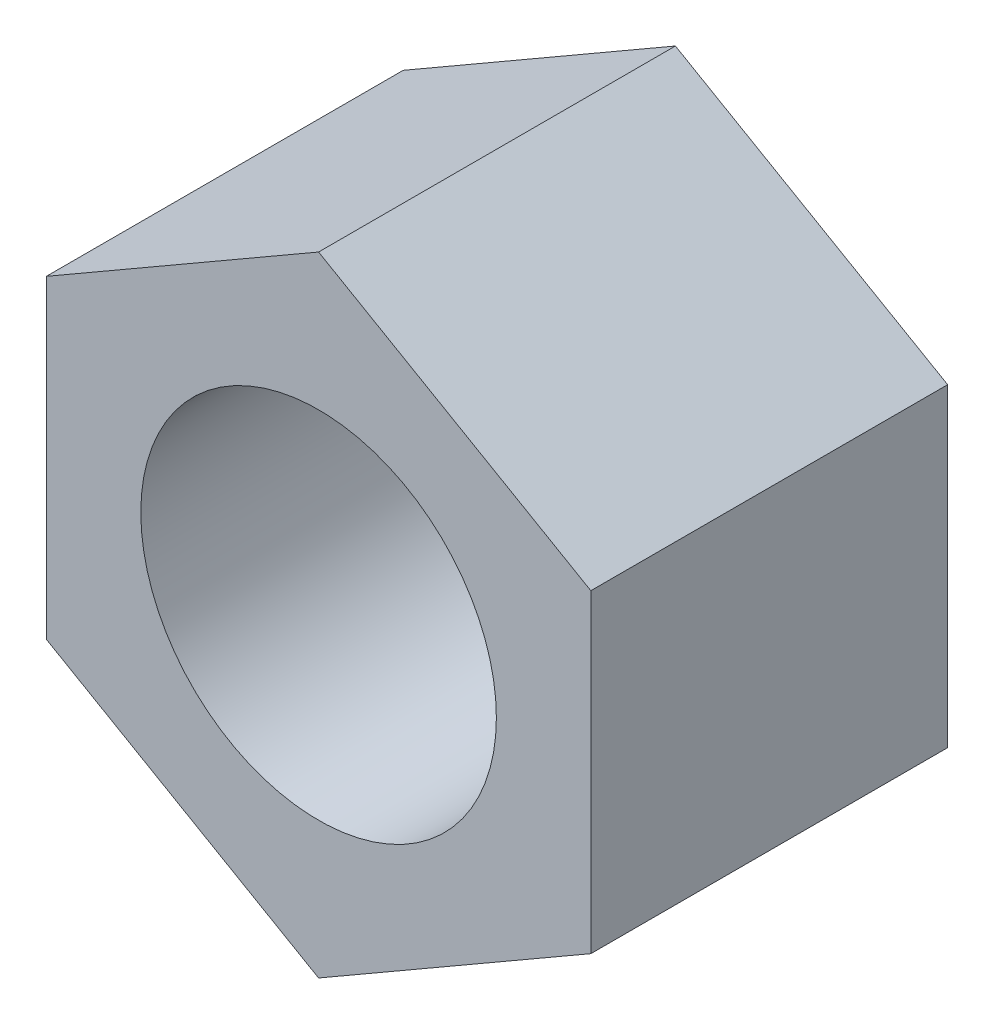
ISO-10303-21;
HEADER;
FILE_DESCRIPTION(('STEP AP214'),'2;1');
FILE_NAME('part.step','',(''),(''),'','','');
FILE_SCHEMA(('AUTOMOTIVE_DESIGN { 1 0 10303 214 1 1 1 1 }'));
ENDSEC;
DATA;
#1=APPLICATION_CONTEXT('core data for automotive mechanical design processes');
#2=APPLICATION_PROTOCOL_DEFINITION('international standard','automotive_design',2000,#1);
#3=PRODUCT_CONTEXT('',#1,'mechanical');
#4=PRODUCT('Part','Part','',(#3));
#5=PRODUCT_RELATED_PRODUCT_CATEGORY('part','',(#4));
#6=PRODUCT_DEFINITION_FORMATION('','',#4);
#7=PRODUCT_DEFINITION_CONTEXT('part definition',#1,'design');
#8=PRODUCT_DEFINITION('design','',#6,#7);
#9=PRODUCT_DEFINITION_SHAPE('','',#8);
#10=(LENGTH_UNIT() NAMED_UNIT(*) SI_UNIT(.MILLI.,.METRE.));
#11=(NAMED_UNIT(*) PLANE_ANGLE_UNIT() SI_UNIT($,.RADIAN.));
#12=(NAMED_UNIT(*) SI_UNIT($,.STERADIAN.) SOLID_ANGLE_UNIT());
#13=UNCERTAINTY_MEASURE_WITH_UNIT(LENGTH_MEASURE(1.E-05),#10,'distance_accuracy_value','');
#14=(GEOMETRIC_REPRESENTATION_CONTEXT(3) GLOBAL_UNCERTAINTY_ASSIGNED_CONTEXT((#13)) GLOBAL_UNIT_ASSIGNED_CONTEXT((#10,
#11,#12)) REPRESENTATION_CONTEXT('',''));
#15=CARTESIAN_POINT('',(0.,0.,0.));
#16=DIRECTION('',(0.,0.,1.));
#17=DIRECTION('',(1.,0.,0.));
#18=AXIS2_PLACEMENT_3D('',#15,#16,#17);
#19=CARTESIAN_POINT('',(0.,0.,101.9556));
#20=DIRECTION('',(0.,0.,1.));
#21=DIRECTION('',(1.,0.,0.));
#22=AXIS2_PLACEMENT_3D('',#19,#20,#21);
#23=PLANE('',#22);
#24=DIRECTION('',(-0.866025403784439,0.5,0.));
#25=VECTOR('',#24,1.);
#26=CARTESIAN_POINT('',(77.7875,44.910634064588,101.9556));
#27=LINE('',#26,#25);
#28=CARTESIAN_POINT('',(77.7875,44.910634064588,101.9556));
#29=VERTEX_POINT('',#28);
#30=CARTESIAN_POINT('',(0.,89.821268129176,101.9556));
#31=VERTEX_POINT('',#30);
#32=EDGE_CURVE('E137',#29,#31,#27,.T.);
#33=ORIENTED_EDGE('',*,*,#32,.T.);
#34=DIRECTION('',(-0.866025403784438,-0.5,0.));
#35=VECTOR('',#34,1.);
#36=CARTESIAN_POINT('',(0.,89.821268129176,101.9556));
#37=LINE('',#36,#35);
#38=CARTESIAN_POINT('',(-77.7875,44.910634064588,101.9556));
#39=VERTEX_POINT('',#38);
#40=EDGE_CURVE('E100',#31,#39,#37,.T.);
#41=ORIENTED_EDGE('',*,*,#40,.T.);
#42=DIRECTION('',(0.,-1.,0.));
#43=VECTOR('',#42,1.);
#44=CARTESIAN_POINT('',(-77.7875,44.910634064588,101.9556));
#45=LINE('',#44,#43);
#46=CARTESIAN_POINT('',(-77.7875,-44.910634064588,101.9556));
#47=VERTEX_POINT('',#46);
#48=EDGE_CURVE('E109',#39,#47,#45,.T.);
#49=ORIENTED_EDGE('',*,*,#48,.T.);
#50=DIRECTION('',(0.866025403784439,-0.5,0.));
#51=VECTOR('',#50,1.);
#52=CARTESIAN_POINT('',(-77.7875,-44.910634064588,101.9556));
#53=LINE('',#52,#51);
#54=CARTESIAN_POINT('',(0.,-89.821268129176,101.9556));
#55=VERTEX_POINT('',#54);
#56=EDGE_CURVE('E102',#47,#55,#53,.T.);
#57=ORIENTED_EDGE('',*,*,#56,.T.);
#58=DIRECTION('',(0.866025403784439,0.5,0.));
#59=VECTOR('',#58,1.);
#60=CARTESIAN_POINT('',(0.,-89.821268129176,101.9556));
#61=LINE('',#60,#59);
#62=CARTESIAN_POINT('',(77.7875,-44.910634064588,101.9556));
#63=VERTEX_POINT('',#62);
#64=EDGE_CURVE('E107',#55,#63,#61,.T.);
#65=ORIENTED_EDGE('',*,*,#64,.T.);
#66=DIRECTION('',(0.,1.,0.));
#67=VECTOR('',#66,1.);
#68=CARTESIAN_POINT('',(77.7875,-44.910634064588,101.9556));
#69=LINE('',#68,#67);
#70=EDGE_CURVE('E58',#63,#29,#69,.T.);
#71=ORIENTED_EDGE('',*,*,#70,.T.);
#72=EDGE_LOOP('',(#33,#41,#49,#57,#65,#71));
#73=FACE_BOUND('',#72,.T.);
#74=CARTESIAN_POINT('',(0.,0.,101.9556));
#75=DIRECTION('',(0.,0.,1.));
#76=DIRECTION('',(1.,0.,0.));
#77=AXIS2_PLACEMENT_3D('',#74,#75,#76);
#78=CIRCLE('',#77,50.8);
#79=CARTESIAN_POINT('',(50.8,0.,101.9556));
#80=VERTEX_POINT('',#79);
#81=EDGE_CURVE('E135',#80,#80,#78,.T.);
#82=ORIENTED_EDGE('',*,*,#81,.F.);
#83=EDGE_LOOP('',(#82));
#84=FACE_BOUND('',#83,.T.);
#85=ADVANCED_FACE('F43',(#73,#84),#23,.T.);
#86=CARTESIAN_POINT('',(0.,0.,0.));
#87=DIRECTION('',(0.,0.,1.));
#88=DIRECTION('',(1.,0.,0.));
#89=AXIS2_PLACEMENT_3D('',#86,#87,#88);
#90=PLANE('',#89);
#91=DIRECTION('',(-0.866025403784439,0.5,0.));
#92=VECTOR('',#91,1.);
#93=CARTESIAN_POINT('',(77.7875,44.910634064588,0.));
#94=LINE('',#93,#92);
#95=CARTESIAN_POINT('',(77.7875,44.910634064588,0.));
#96=VERTEX_POINT('',#95);
#97=CARTESIAN_POINT('',(0.,89.821268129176,0.));
#98=VERTEX_POINT('',#97);
#99=EDGE_CURVE('E126',#96,#98,#94,.T.);
#100=ORIENTED_EDGE('',*,*,#99,.F.);
#101=DIRECTION('',(0.,1.,0.));
#102=VECTOR('',#101,1.);
#103=CARTESIAN_POINT('',(77.7875,-44.910634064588,0.));
#104=LINE('',#103,#102);
#105=CARTESIAN_POINT('',(77.7875,-44.910634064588,0.));
#106=VERTEX_POINT('',#105);
#107=EDGE_CURVE('E90',#106,#96,#104,.T.);
#108=ORIENTED_EDGE('',*,*,#107,.F.);
#109=DIRECTION('',(0.866025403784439,0.5,0.));
#110=VECTOR('',#109,1.);
#111=CARTESIAN_POINT('',(0.,-89.821268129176,0.));
#112=LINE('',#111,#110);
#113=CARTESIAN_POINT('',(0.,-89.821268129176,0.));
#114=VERTEX_POINT('',#113);
#115=EDGE_CURVE('E83',#114,#106,#112,.T.);
#116=ORIENTED_EDGE('',*,*,#115,.F.);
#117=DIRECTION('',(0.866025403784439,-0.5,0.));
#118=VECTOR('',#117,1.);
#119=CARTESIAN_POINT('',(-77.7875,-44.910634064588,0.));
#120=LINE('',#119,#118);
#121=CARTESIAN_POINT('',(-77.7875,-44.910634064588,0.));
#122=VERTEX_POINT('',#121);
#123=EDGE_CURVE('E119',#122,#114,#120,.T.);
#124=ORIENTED_EDGE('',*,*,#123,.F.);
#125=DIRECTION('',(0.,-1.,0.));
#126=VECTOR('',#125,1.);
#127=CARTESIAN_POINT('',(-77.7875,44.910634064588,0.));
#128=LINE('',#127,#126);
#129=CARTESIAN_POINT('',(-77.7875,44.910634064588,0.));
#130=VERTEX_POINT('',#129);
#131=EDGE_CURVE('E131',#130,#122,#128,.T.);
#132=ORIENTED_EDGE('',*,*,#131,.F.);
#133=DIRECTION('',(-0.866025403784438,-0.5,0.));
#134=VECTOR('',#133,1.);
#135=CARTESIAN_POINT('',(0.,89.821268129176,0.));
#136=LINE('',#135,#134);
#137=EDGE_CURVE('E132',#98,#130,#136,.T.);
#138=ORIENTED_EDGE('',*,*,#137,.F.);
#139=EDGE_LOOP('',(#100,#108,#116,#124,#132,#138));
#140=FACE_BOUND('',#139,.T.);
#141=CARTESIAN_POINT('',(0.,0.,0.));
#142=DIRECTION('',(0.,0.,1.));
#143=DIRECTION('',(1.,0.,0.));
#144=AXIS2_PLACEMENT_3D('',#141,#142,#143);
#145=CIRCLE('',#144,50.8);
#146=CARTESIAN_POINT('',(50.8,0.,0.));
#147=VERTEX_POINT('',#146);
#148=EDGE_CURVE('E235',#147,#147,#145,.T.);
#149=ORIENTED_EDGE('',*,*,#148,.T.);
#150=EDGE_LOOP('',(#149));
#151=FACE_BOUND('',#150,.T.);
#152=ADVANCED_FACE('F146',(#140,#151),#90,.F.);
#153=CARTESIAN_POINT('',(77.7875,44.910634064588,101.9556));
#154=DIRECTION('',(-0.5,-0.866025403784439,0.));
#155=DIRECTION('',(0.866025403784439,-0.5,0.));
#156=AXIS2_PLACEMENT_3D('',#153,#154,#155);
#157=PLANE('',#156);
#158=ORIENTED_EDGE('',*,*,#99,.T.);
#159=DIRECTION('',(0.,0.,-1.));
#160=VECTOR('',#159,1.);
#161=CARTESIAN_POINT('',(0.,89.821268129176,101.9556));
#162=LINE('',#161,#160);
#163=EDGE_CURVE('E11',#31,#98,#162,.T.);
#164=ORIENTED_EDGE('',*,*,#163,.F.);
#165=ORIENTED_EDGE('',*,*,#32,.F.);
#166=DIRECTION('',(0.,0.,-1.));
#167=VECTOR('',#166,1.);
#168=CARTESIAN_POINT('',(77.7875,44.910634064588,101.9556));
#169=LINE('',#168,#167);
#170=EDGE_CURVE('E122',#29,#96,#169,.T.);
#171=ORIENTED_EDGE('',*,*,#170,.T.);
#172=EDGE_LOOP('',(#158,#164,#165,#171));
#173=FACE_BOUND('',#172,.T.);
#174=ADVANCED_FACE('F44',(#173),#157,.F.);
#175=CARTESIAN_POINT('',(0.,89.821268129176,101.9556));
#176=DIRECTION('',(0.5,-0.866025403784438,0.));
#177=DIRECTION('',(0.866025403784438,0.5,0.));
#178=AXIS2_PLACEMENT_3D('',#175,#176,#177);
#179=PLANE('',#178);
#180=ORIENTED_EDGE('',*,*,#137,.T.);
#181=DIRECTION('',(0.,0.,-1.));
#182=VECTOR('',#181,1.);
#183=CARTESIAN_POINT('',(-77.7875,44.910634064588,101.9556));
#184=LINE('',#183,#182);
#185=EDGE_CURVE('E55',#39,#130,#184,.T.);
#186=ORIENTED_EDGE('',*,*,#185,.F.);
#187=ORIENTED_EDGE('',*,*,#40,.F.);
#188=ORIENTED_EDGE('',*,*,#163,.T.);
#189=EDGE_LOOP('',(#180,#186,#187,#188));
#190=FACE_BOUND('',#189,.T.);
#191=ADVANCED_FACE('F174',(#190),#179,.F.);
#192=CARTESIAN_POINT('',(-77.7875,44.910634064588,101.9556));
#193=DIRECTION('',(1.,0.,0.));
#194=DIRECTION('',(0.,1.,0.));
#195=AXIS2_PLACEMENT_3D('',#192,#193,#194);
#196=PLANE('',#195);
#197=ORIENTED_EDGE('',*,*,#131,.T.);
#198=DIRECTION('',(0.,0.,-1.));
#199=VECTOR('',#198,1.);
#200=CARTESIAN_POINT('',(-77.7875,-44.910634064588,101.9556));
#201=LINE('',#200,#199);
#202=EDGE_CURVE('E116',#47,#122,#201,.T.);
#203=ORIENTED_EDGE('',*,*,#202,.F.);
#204=ORIENTED_EDGE('',*,*,#48,.F.);
#205=ORIENTED_EDGE('',*,*,#185,.T.);
#206=EDGE_LOOP('',(#197,#203,#204,#205));
#207=FACE_BOUND('',#206,.T.);
#208=ADVANCED_FACE('F144',(#207),#196,.F.);
#209=CARTESIAN_POINT('',(-77.7875,-44.910634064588,101.9556));
#210=DIRECTION('',(0.5,0.866025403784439,0.));
#211=DIRECTION('',(-0.866025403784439,0.5,0.));
#212=AXIS2_PLACEMENT_3D('',#209,#210,#211);
#213=PLANE('',#212);
#214=ORIENTED_EDGE('',*,*,#123,.T.);
#215=DIRECTION('',(0.,0.,-1.));
#216=VECTOR('',#215,1.);
#217=CARTESIAN_POINT('',(0.,-89.821268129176,101.9556));
#218=LINE('',#217,#216);
#219=EDGE_CURVE('E113',#55,#114,#218,.T.);
#220=ORIENTED_EDGE('',*,*,#219,.F.);
#221=ORIENTED_EDGE('',*,*,#56,.F.);
#222=ORIENTED_EDGE('',*,*,#202,.T.);
#223=EDGE_LOOP('',(#214,#220,#221,#222));
#224=FACE_BOUND('',#223,.T.);
#225=ADVANCED_FACE('F117',(#224),#213,.F.);
#226=CARTESIAN_POINT('',(0.,-89.821268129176,101.9556));
#227=DIRECTION('',(-0.5,0.866025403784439,0.));
#228=DIRECTION('',(-0.866025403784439,-0.5,0.));
#229=AXIS2_PLACEMENT_3D('',#226,#227,#228);
#230=PLANE('',#229);
#231=ORIENTED_EDGE('',*,*,#115,.T.);
#232=DIRECTION('',(0.,0.,-1.));
#233=VECTOR('',#232,1.);
#234=CARTESIAN_POINT('',(77.7875,-44.910634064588,101.9556));
#235=LINE('',#234,#233);
#236=EDGE_CURVE('E118',#63,#106,#235,.T.);
#237=ORIENTED_EDGE('',*,*,#236,.F.);
#238=ORIENTED_EDGE('',*,*,#64,.F.);
#239=ORIENTED_EDGE('',*,*,#219,.T.);
#240=EDGE_LOOP('',(#231,#237,#238,#239));
#241=FACE_BOUND('',#240,.T.);
#242=ADVANCED_FACE('F125',(#241),#230,.F.);
#243=CARTESIAN_POINT('',(77.7875,-44.910634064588,101.9556));
#244=DIRECTION('',(-1.,0.,0.));
#245=DIRECTION('',(0.,0.,1.));
#246=AXIS2_PLACEMENT_3D('',#243,#244,#245);
#247=PLANE('',#246);
#248=ORIENTED_EDGE('',*,*,#107,.T.);
#249=ORIENTED_EDGE('',*,*,#170,.F.);
#250=ORIENTED_EDGE('',*,*,#70,.F.);
#251=ORIENTED_EDGE('',*,*,#236,.T.);
#252=EDGE_LOOP('',(#248,#249,#250,#251));
#253=FACE_BOUND('',#252,.T.);
#254=ADVANCED_FACE('F153',(#253),#247,.F.);
#255=CARTESIAN_POINT('',(0.,0.,101.9556));
#256=DIRECTION('',(0.,0.,-1.));
#257=DIRECTION('',(-1.,0.,0.));
#258=AXIS2_PLACEMENT_3D('',#255,#256,#257);
#259=CYLINDRICAL_SURFACE('',#258,50.8);
#260=ORIENTED_EDGE('',*,*,#81,.T.);
#261=EDGE_LOOP('',(#260));
#262=FACE_BOUND('',#261,.T.);
#263=ORIENTED_EDGE('',*,*,#148,.F.);
#264=EDGE_LOOP('',(#263));
#265=FACE_BOUND('',#264,.T.);
#266=ADVANCED_FACE('F154',(#262,#265),#259,.F.);
#267=CLOSED_SHELL('',(#85,#152,#174,#191,#208,#225,#242,#254,#266));
#268=MANIFOLD_SOLID_BREP('B2',#267);
#269=ADVANCED_BREP_SHAPE_REPRESENTATION('',(#18,#268),#14);
#270=SHAPE_DEFINITION_REPRESENTATION(#9,#269);
ENDSEC;
END-ISO-10303-21;
